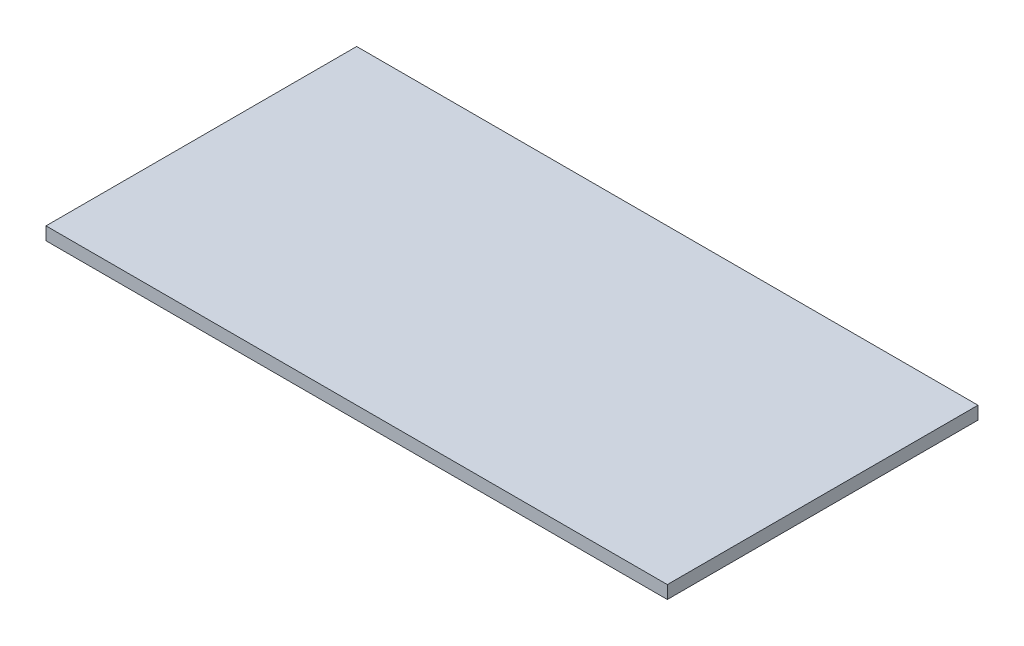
from build123d import *

# Parameters (mm, degrees)
SKIZZE1_W                       = 2400
SKIZZE1_H                       = 1200
AUFSATZ_LINEAR_AUSTRAGEN1_DEPTH = 50


with BuildPart() as part:
    # Skizze1 → Aufsatz-Linear austragen1 (new body)
    with BuildSketch(Plane(origin=(0, 0, 0), x_dir=(1, 0, 0), z_dir=(0, 1, 0))):
        with Locations((0, 100)):
            Rectangle(SKIZZE1_W, SKIZZE1_H)
    extrude(amount=AUFSATZ_LINEAR_AUSTRAGEN1_DEPTH)


solid = part.part
